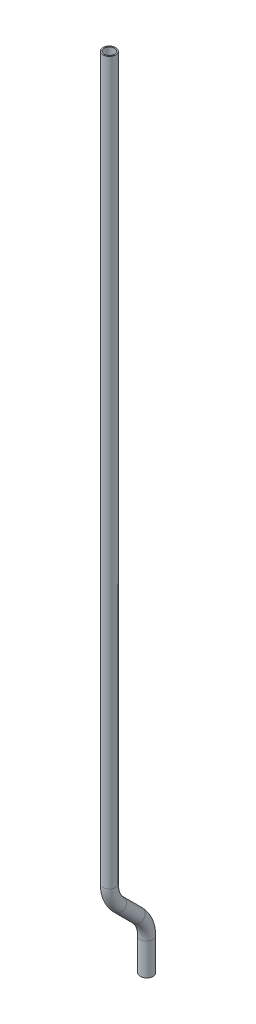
ISO-10303-21;
HEADER;
FILE_DESCRIPTION(('STEP AP214'),'2;1');
FILE_NAME('part.step','',(''),(''),'','','');
FILE_SCHEMA(('AUTOMOTIVE_DESIGN { 1 0 10303 214 1 1 1 1 }'));
ENDSEC;
DATA;
#1=APPLICATION_CONTEXT('core data for automotive mechanical design processes');
#2=APPLICATION_PROTOCOL_DEFINITION('international standard','automotive_design',2000,#1);
#3=PRODUCT_CONTEXT('',#1,'mechanical');
#4=PRODUCT('Part','Part','',(#3));
#5=PRODUCT_RELATED_PRODUCT_CATEGORY('part','',(#4));
#6=PRODUCT_DEFINITION_FORMATION('','',#4);
#7=PRODUCT_DEFINITION_CONTEXT('part definition',#1,'design');
#8=PRODUCT_DEFINITION('design','',#6,#7);
#9=PRODUCT_DEFINITION_SHAPE('','',#8);
#10=(LENGTH_UNIT() NAMED_UNIT(*) SI_UNIT(.MILLI.,.METRE.));
#11=(NAMED_UNIT(*) PLANE_ANGLE_UNIT() SI_UNIT($,.RADIAN.));
#12=(NAMED_UNIT(*) SI_UNIT($,.STERADIAN.) SOLID_ANGLE_UNIT());
#13=UNCERTAINTY_MEASURE_WITH_UNIT(LENGTH_MEASURE(1.E-05),#10,'distance_accuracy_value','');
#14=(GEOMETRIC_REPRESENTATION_CONTEXT(3) GLOBAL_UNCERTAINTY_ASSIGNED_CONTEXT((#13)) GLOBAL_UNIT_ASSIGNED_CONTEXT((#10,
#11,#12)) REPRESENTATION_CONTEXT('',''));
#15=CARTESIAN_POINT('',(0.,0.,0.));
#16=DIRECTION('',(0.,0.,1.));
#17=DIRECTION('',(1.,0.,0.));
#18=AXIS2_PLACEMENT_3D('',#15,#16,#17);
#19=CARTESIAN_POINT('',(0.,71.4794209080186,27.94));
#20=DIRECTION('',(0.,1.,0.));
#21=DIRECTION('',(0.,0.,1.));
#22=AXIS2_PLACEMENT_3D('',#19,#20,#21);
#23=CYLINDRICAL_SURFACE('',#22,4.7625);
#24=CARTESIAN_POINT('',(0.,71.4794209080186,27.94));
#25=DIRECTION('',(0.,1.,0.));
#26=DIRECTION('',(0.,0.,1.));
#27=AXIS2_PLACEMENT_3D('',#24,#25,#26);
#28=CIRCLE('',#27,4.7625);
#29=CARTESIAN_POINT('',(0.,71.4794209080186,32.7025));
#30=VERTEX_POINT('',#29);
#31=EDGE_CURVE('E41',#30,#30,#28,.T.);
#32=ORIENTED_EDGE('',*,*,#31,.T.);
#33=EDGE_LOOP('',(#32));
#34=FACE_BOUND('',#33,.T.);
#35=CARTESIAN_POINT('',(0.,609.6,27.94));
#36=DIRECTION('',(0.,1.,0.));
#37=DIRECTION('',(0.,0.,1.));
#38=AXIS2_PLACEMENT_3D('',#35,#36,#37);
#39=CIRCLE('',#38,4.7625);
#40=CARTESIAN_POINT('',(0.,609.6,32.7025));
#41=VERTEX_POINT('',#40);
#42=EDGE_CURVE('E10',#41,#41,#39,.T.);
#43=ORIENTED_EDGE('',*,*,#42,.F.);
#44=EDGE_LOOP('',(#43));
#45=FACE_BOUND('',#44,.T.);
#46=ADVANCED_FACE('F31',(#34,#45),#23,.T.);
#47=CARTESIAN_POINT('',(0.,71.4794209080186,27.94));
#48=DIRECTION('',(0.,1.,0.));
#49=DIRECTION('',(0.,0.,1.));
#50=AXIS2_PLACEMENT_3D('',#47,#48,#49);
#51=CYLINDRICAL_SURFACE('',#50,3.8735);
#52=CARTESIAN_POINT('',(0.,71.4794209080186,27.94));
#53=DIRECTION('',(0.,1.,0.));
#54=DIRECTION('',(0.,0.,1.));
#55=AXIS2_PLACEMENT_3D('',#52,#53,#54);
#56=CIRCLE('',#55,3.8735);
#57=CARTESIAN_POINT('',(0.,71.4794209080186,31.8135));
#58=VERTEX_POINT('',#57);
#59=EDGE_CURVE('E45',#58,#58,#56,.T.);
#60=ORIENTED_EDGE('',*,*,#59,.F.);
#61=EDGE_LOOP('',(#60));
#62=FACE_BOUND('',#61,.T.);
#63=CARTESIAN_POINT('',(0.,609.6,27.94));
#64=DIRECTION('',(0.,1.,0.));
#65=DIRECTION('',(0.,0.,1.));
#66=AXIS2_PLACEMENT_3D('',#63,#64,#65);
#67=CIRCLE('',#66,3.8735);
#68=CARTESIAN_POINT('',(0.,609.6,31.8135));
#69=VERTEX_POINT('',#68);
#70=EDGE_CURVE('E37',#69,#69,#67,.T.);
#71=ORIENTED_EDGE('',*,*,#70,.T.);
#72=EDGE_LOOP('',(#71));
#73=FACE_BOUND('',#72,.T.);
#74=ADVANCED_FACE('F99',(#62,#73),#51,.F.);
#75=CARTESIAN_POINT('',(0.,71.4794209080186,4.1275));
#76=DIRECTION('',(-1.,0.,0.));
#77=DIRECTION('',(0.,0.,1.));
#78=AXIS2_PLACEMENT_3D('',#75,#76,#77);
#79=TOROIDAL_SURFACE('',#78,23.8125,4.7625);
#80=CARTESIAN_POINT('',(0.,54.6414406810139,20.9654802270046));
#81=DIRECTION('',(0.,0.707106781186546,0.707106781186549));
#82=DIRECTION('',(0.,-0.707106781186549,0.707106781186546));
#83=AXIS2_PLACEMENT_3D('',#80,#81,#82);
#84=CIRCLE('',#83,4.7625);
#85=CARTESIAN_POINT('',(0.,51.273844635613,24.3330762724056));
#86=VERTEX_POINT('',#85);
#87=EDGE_CURVE('E50',#86,#86,#84,.T.);
#88=CARTESIAN_POINT('',(0.,71.4794209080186,4.1275));
#89=DIRECTION('',(-1.,0.,0.));
#90=DIRECTION('',(0.,0.,1.));
#91=AXIS2_PLACEMENT_3D('',#88,#89,#90);
#92=CIRCLE('',#91,28.575);
#93=EDGE_CURVE('',#86,#30,#92,.T.);
#94=ORIENTED_EDGE('',*,*,#87,.T.);
#95=ORIENTED_EDGE('',*,*,#31,.F.);
#96=ORIENTED_EDGE('',*,*,#93,.T.);
#97=ORIENTED_EDGE('',*,*,#93,.F.);
#98=EDGE_LOOP('',(#94,#96,#95,#97));
#99=FACE_BOUND('',#98,.T.);
#100=ADVANCED_FACE('F95',(#99),#79,.T.);
#101=CARTESIAN_POINT('',(0.,71.4794209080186,4.1275));
#102=DIRECTION('',(-1.,0.,0.));
#103=DIRECTION('',(0.,0.,1.));
#104=AXIS2_PLACEMENT_3D('',#101,#102,#103);
#105=TOROIDAL_SURFACE('',#104,23.8125,3.8735);
#106=CARTESIAN_POINT('',(0.,54.6414406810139,20.9654802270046));
#107=DIRECTION('',(0.,0.707106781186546,0.707106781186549));
#108=DIRECTION('',(0.,-0.707106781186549,0.707106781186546));
#109=AXIS2_PLACEMENT_3D('',#106,#107,#108);
#110=CIRCLE('',#109,3.8735);
#111=CARTESIAN_POINT('',(0.,51.9024625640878,23.7044583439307));
#112=VERTEX_POINT('',#111);
#113=EDGE_CURVE('E53',#112,#112,#110,.T.);
#114=CARTESIAN_POINT('',(0.,71.4794209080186,4.1275));
#115=DIRECTION('',(-1.,0.,0.));
#116=DIRECTION('',(0.,0.,1.));
#117=AXIS2_PLACEMENT_3D('',#114,#115,#116);
#118=CIRCLE('',#117,27.686);
#119=EDGE_CURVE('',#112,#58,#118,.T.);
#120=ORIENTED_EDGE('',*,*,#113,.F.);
#121=ORIENTED_EDGE('',*,*,#59,.T.);
#122=ORIENTED_EDGE('',*,*,#119,.T.);
#123=ORIENTED_EDGE('',*,*,#119,.F.);
#124=EDGE_LOOP('',(#120,#122,#121,#123));
#125=FACE_BOUND('',#124,.T.);
#126=ADVANCED_FACE('F92',(#125),#105,.F.);
#127=CARTESIAN_POINT('',(0.,40.6504802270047,6.97451977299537));
#128=DIRECTION('',(0.,0.707106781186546,0.707106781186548));
#129=DIRECTION('',(0.,-0.707106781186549,0.707106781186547));
#130=AXIS2_PLACEMENT_3D('',#127,#128,#129);
#131=CYLINDRICAL_SURFACE('',#130,4.7625);
#132=CARTESIAN_POINT('',(0.,40.6504802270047,6.97451977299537));
#133=DIRECTION('',(0.,0.707106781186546,0.707106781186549));
#134=DIRECTION('',(0.,-0.707106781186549,0.707106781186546));
#135=AXIS2_PLACEMENT_3D('',#132,#133,#134);
#136=CIRCLE('',#135,4.7625);
#137=CARTESIAN_POINT('',(0.,44.0180762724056,3.60692372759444));
#138=VERTEX_POINT('',#137);
#139=EDGE_CURVE('E56',#138,#138,#136,.T.);
#140=ORIENTED_EDGE('',*,*,#139,.T.);
#141=EDGE_LOOP('',(#140));
#142=FACE_BOUND('',#141,.T.);
#143=ORIENTED_EDGE('',*,*,#87,.F.);
#144=EDGE_LOOP('',(#143));
#145=FACE_BOUND('',#144,.T.);
#146=ADVANCED_FACE('F88',(#142,#145),#131,.T.);
#147=CARTESIAN_POINT('',(0.,40.6504802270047,6.97451977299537));
#148=DIRECTION('',(0.,0.707106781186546,0.707106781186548));
#149=DIRECTION('',(0.,-0.707106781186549,0.707106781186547));
#150=AXIS2_PLACEMENT_3D('',#147,#148,#149);
#151=CYLINDRICAL_SURFACE('',#150,3.8735);
#152=CARTESIAN_POINT('',(0.,40.6504802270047,6.97451977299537));
#153=DIRECTION('',(0.,0.707106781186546,0.707106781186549));
#154=DIRECTION('',(0.,-0.707106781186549,0.707106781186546));
#155=AXIS2_PLACEMENT_3D('',#152,#153,#154);
#156=CIRCLE('',#155,3.8735);
#157=CARTESIAN_POINT('',(0.,43.3894583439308,4.23554165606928));
#158=VERTEX_POINT('',#157);
#159=EDGE_CURVE('E59',#158,#158,#156,.T.);
#160=ORIENTED_EDGE('',*,*,#159,.F.);
#161=EDGE_LOOP('',(#160));
#162=FACE_BOUND('',#161,.T.);
#163=ORIENTED_EDGE('',*,*,#113,.T.);
#164=EDGE_LOOP('',(#163));
#165=FACE_BOUND('',#164,.T.);
#166=ADVANCED_FACE('F85',(#162,#165),#151,.F.);
#167=CARTESIAN_POINT('',(0.,23.8125,23.8125));
#168=DIRECTION('',(1.,0.,0.));
#169=DIRECTION('',(0.,0.,-1.));
#170=AXIS2_PLACEMENT_3D('',#167,#168,#169);
#171=TOROIDAL_SURFACE('',#170,23.8125,4.7625);
#172=CARTESIAN_POINT('',(0.,23.8125,0.));
#173=DIRECTION('',(0.,1.,0.));
#174=DIRECTION('',(0.,0.,1.));
#175=AXIS2_PLACEMENT_3D('',#172,#173,#174);
#176=CIRCLE('',#175,4.7625);
#177=CARTESIAN_POINT('',(0.,23.8125,-4.7625));
#178=VERTEX_POINT('',#177);
#179=EDGE_CURVE('E62',#178,#178,#176,.T.);
#180=CARTESIAN_POINT('',(0.,23.8125,23.8125));
#181=DIRECTION('',(1.,0.,0.));
#182=DIRECTION('',(0.,0.,-1.));
#183=AXIS2_PLACEMENT_3D('',#180,#181,#182);
#184=CIRCLE('',#183,28.575);
#185=EDGE_CURVE('',#178,#138,#184,.T.);
#186=ORIENTED_EDGE('',*,*,#179,.T.);
#187=ORIENTED_EDGE('',*,*,#139,.F.);
#188=ORIENTED_EDGE('',*,*,#185,.T.);
#189=ORIENTED_EDGE('',*,*,#185,.F.);
#190=EDGE_LOOP('',(#186,#188,#187,#189));
#191=FACE_BOUND('',#190,.T.);
#192=ADVANCED_FACE('F81',(#191),#171,.T.);
#193=CARTESIAN_POINT('',(0.,23.8125,23.8125));
#194=DIRECTION('',(1.,0.,0.));
#195=DIRECTION('',(0.,0.,-1.));
#196=AXIS2_PLACEMENT_3D('',#193,#194,#195);
#197=TOROIDAL_SURFACE('',#196,23.8125,3.8735);
#198=CARTESIAN_POINT('',(0.,23.8125,0.));
#199=DIRECTION('',(0.,1.,0.));
#200=DIRECTION('',(0.,0.,1.));
#201=AXIS2_PLACEMENT_3D('',#198,#199,#200);
#202=CIRCLE('',#201,3.8735);
#203=CARTESIAN_POINT('',(0.,23.8125,-3.8735));
#204=VERTEX_POINT('',#203);
#205=EDGE_CURVE('E66',#204,#204,#202,.T.);
#206=CARTESIAN_POINT('',(0.,23.8125,23.8125));
#207=DIRECTION('',(1.,0.,0.));
#208=DIRECTION('',(0.,0.,-1.));
#209=AXIS2_PLACEMENT_3D('',#206,#207,#208);
#210=CIRCLE('',#209,27.686);
#211=EDGE_CURVE('',#204,#158,#210,.T.);
#212=ORIENTED_EDGE('',*,*,#205,.F.);
#213=ORIENTED_EDGE('',*,*,#159,.T.);
#214=ORIENTED_EDGE('',*,*,#211,.T.);
#215=ORIENTED_EDGE('',*,*,#211,.F.);
#216=EDGE_LOOP('',(#212,#214,#213,#215));
#217=FACE_BOUND('',#216,.T.);
#218=ADVANCED_FACE('F78',(#217),#197,.F.);
#219=CARTESIAN_POINT('',(0.,23.8125,0.));
#220=DIRECTION('',(0.,-1.,0.));
#221=DIRECTION('',(0.,0.,-1.));
#222=AXIS2_PLACEMENT_3D('',#219,#220,#221);
#223=CYLINDRICAL_SURFACE('',#222,3.8735);
#224=ORIENTED_EDGE('',*,*,#205,.T.);
#225=EDGE_LOOP('',(#224));
#226=FACE_BOUND('',#225,.T.);
#227=CARTESIAN_POINT('',(0.,0.,0.));
#228=DIRECTION('',(0.,1.,0.));
#229=DIRECTION('',(0.,0.,1.));
#230=AXIS2_PLACEMENT_3D('',#227,#228,#229);
#231=CIRCLE('',#230,3.8735);
#232=CARTESIAN_POINT('',(0.,0.,3.8735));
#233=VERTEX_POINT('',#232);
#234=EDGE_CURVE('E67',#233,#233,#231,.T.);
#235=ORIENTED_EDGE('',*,*,#234,.F.);
#236=EDGE_LOOP('',(#235));
#237=FACE_BOUND('',#236,.T.);
#238=ADVANCED_FACE('F75',(#226,#237),#223,.F.);
#239=CARTESIAN_POINT('',(0.,23.8125,0.));
#240=DIRECTION('',(0.,-1.,0.));
#241=DIRECTION('',(0.,0.,-1.));
#242=AXIS2_PLACEMENT_3D('',#239,#240,#241);
#243=CYLINDRICAL_SURFACE('',#242,4.7625);
#244=ORIENTED_EDGE('',*,*,#179,.F.);
#245=EDGE_LOOP('',(#244));
#246=FACE_BOUND('',#245,.T.);
#247=CARTESIAN_POINT('',(0.,0.,0.));
#248=DIRECTION('',(0.,1.,0.));
#249=DIRECTION('',(0.,0.,1.));
#250=AXIS2_PLACEMENT_3D('',#247,#248,#249);
#251=CIRCLE('',#250,4.7625);
#252=CARTESIAN_POINT('',(0.,0.,4.7625));
#253=VERTEX_POINT('',#252);
#254=EDGE_CURVE('E63',#253,#253,#251,.T.);
#255=ORIENTED_EDGE('',*,*,#254,.T.);
#256=EDGE_LOOP('',(#255));
#257=FACE_BOUND('',#256,.T.);
#258=ADVANCED_FACE('F117',(#246,#257),#243,.T.);
#259=CARTESIAN_POINT('',(0.,609.6,27.94));
#260=DIRECTION('',(0.,1.,0.));
#261=DIRECTION('',(0.,0.,1.));
#262=AXIS2_PLACEMENT_3D('',#259,#260,#261);
#263=PLANE('',#262);
#264=ORIENTED_EDGE('',*,*,#70,.F.);
#265=EDGE_LOOP('',(#264));
#266=FACE_BOUND('',#265,.T.);
#267=ORIENTED_EDGE('',*,*,#42,.T.);
#268=EDGE_LOOP('',(#267));
#269=FACE_BOUND('',#268,.T.);
#270=ADVANCED_FACE('F120',(#266,#269),#263,.T.);
#271=CARTESIAN_POINT('',(0.,0.,0.));
#272=DIRECTION('',(0.,1.,0.));
#273=DIRECTION('',(0.,0.,1.));
#274=AXIS2_PLACEMENT_3D('',#271,#272,#273);
#275=PLANE('',#274);
#276=ORIENTED_EDGE('',*,*,#234,.T.);
#277=EDGE_LOOP('',(#276));
#278=FACE_BOUND('',#277,.T.);
#279=ORIENTED_EDGE('',*,*,#254,.F.);
#280=EDGE_LOOP('',(#279));
#281=FACE_BOUND('',#280,.T.);
#282=ADVANCED_FACE('F122',(#278,#281),#275,.F.);
#283=CLOSED_SHELL('',(#46,#74,#100,#126,#146,#166,#192,#218,#238,#258,#270,#282));
#284=MANIFOLD_SOLID_BREP('B2',#283);
#285=ADVANCED_BREP_SHAPE_REPRESENTATION('',(#18,#284),#14);
#286=SHAPE_DEFINITION_REPRESENTATION(#9,#285);
ENDSEC;
END-ISO-10303-21;
